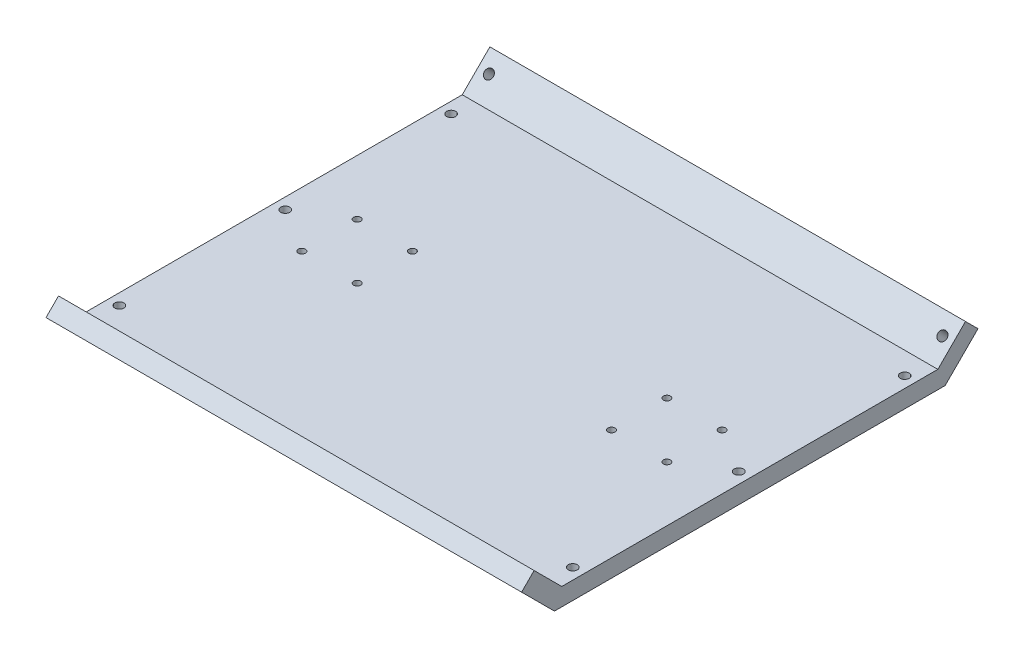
from build123d import *

# Parameters (mm, degrees)
MAIN_DEPTH                      = 107.5
F_4_0MM_DOWEL_HOLE1_D           = 4.1
F_4_0MM_DOWEL_HOLE1_ON_FACE_2_D = 4.1
F_4_0MM_DOWEL_HOLE1_ON_FACE_3_D = 4.1
F_4_0MM_DOWEL_HOLE1_ON_FACE_4_D = 4.1
SKETCH4_R                       = 1.6
ATTACHMENT_SCREW_HOLES_DEPTH    = 151.392275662


with BuildPart() as part:
    # Sketch2 → Main (new, symmetric)
    with BuildSketch(Plane(origin=(0, 0, 0), x_dir=(0, 0, -1), z_dir=(1, 0, 0))):
        Polygon((-85, 0), (85, 0), (97.5, 12.5), (103.156854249, 6.843145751), (88.313708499, -8), (-88.313708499, -8), (-103.156854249, 6.843145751), (-97.5, 12.5), align=None)
    extrude(amount=MAIN_DEPTH, both=True)

    # 4.0mm Dowel Hole1 (through all)
    with Locations(Plane(origin=(-102.5, 7.071067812, -92.071067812), x_dir=(0, 0.707106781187, -0.707106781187), z_dir=(0, 0.707106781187, 0.707106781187))):
        with Locations((0, 0)):
            Hole(F_4_0MM_DOWEL_HOLE1_D / 2)

    # 4.0mm Dowel Hole1 on face 2 (through all)
    with Locations(Plane(origin=(-102.5, 0, -75), x_dir=(0, 0, 1), z_dir=(0, 1, 0))):
        with Locations((0, 0), (75, 0), (150, 0), (150, 205), (75, 205), (0, 205)):
            Hole(F_4_0MM_DOWEL_HOLE1_ON_FACE_2_D / 2)

    # 4.0mm Dowel Hole1 on face 3 (through all)
    with Locations(Plane(origin=(-102.5, 7.071067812, 92.071067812), x_dir=(0, -0.707106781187, -0.707106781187), z_dir=(0, 0.707106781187, -0.707106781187))):
        with Locations((0, 0), (0, -205)):
            Hole(F_4_0MM_DOWEL_HOLE1_ON_FACE_3_D / 2)

    # 4.0mm Dowel Hole1 on face 4 (through all)
    with Locations(Plane(origin=(102.5, 7.071067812, -92.071067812), x_dir=(0, 0.707106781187, -0.707106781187), z_dir=(0, 0.707106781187, 0.707106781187))):
        with Locations((0, 0)):
            Hole(F_4_0MM_DOWEL_HOLE1_ON_FACE_4_D / 2)

    # Sketch4 → Attachment screw holes (cut, through all)
    with BuildSketch(Plane.XZ.offset(8)):
        with Locations(Location((57.5, 12.5, 0), (0, 0, 270))):
            Circle(SKETCH4_R)
        with Locations(Location((82.5, 12.5, 0), (0, 0, 270))):
            Circle(SKETCH4_R)
        with Locations(Location((82.5, -12.5, 0), (0, 0, 270))):
            Circle(SKETCH4_R)
        with Locations(Location((57.5, -12.5, 0), (0, 0, 270))):
            Circle(SKETCH4_R)
    attachment_screw_holes = extrude(amount=-ATTACHMENT_SCREW_HOLES_DEPTH, mode=Mode.SUBTRACT)

    # Mirror1: Attachment screw holes across plane
    add(attachment_screw_holes.mirror(Plane(origin=(0, 0, 0), x_dir=(0, 0, 1), z_dir=(1, 0, 0))), mode=Mode.SUBTRACT)


solid = part.part
